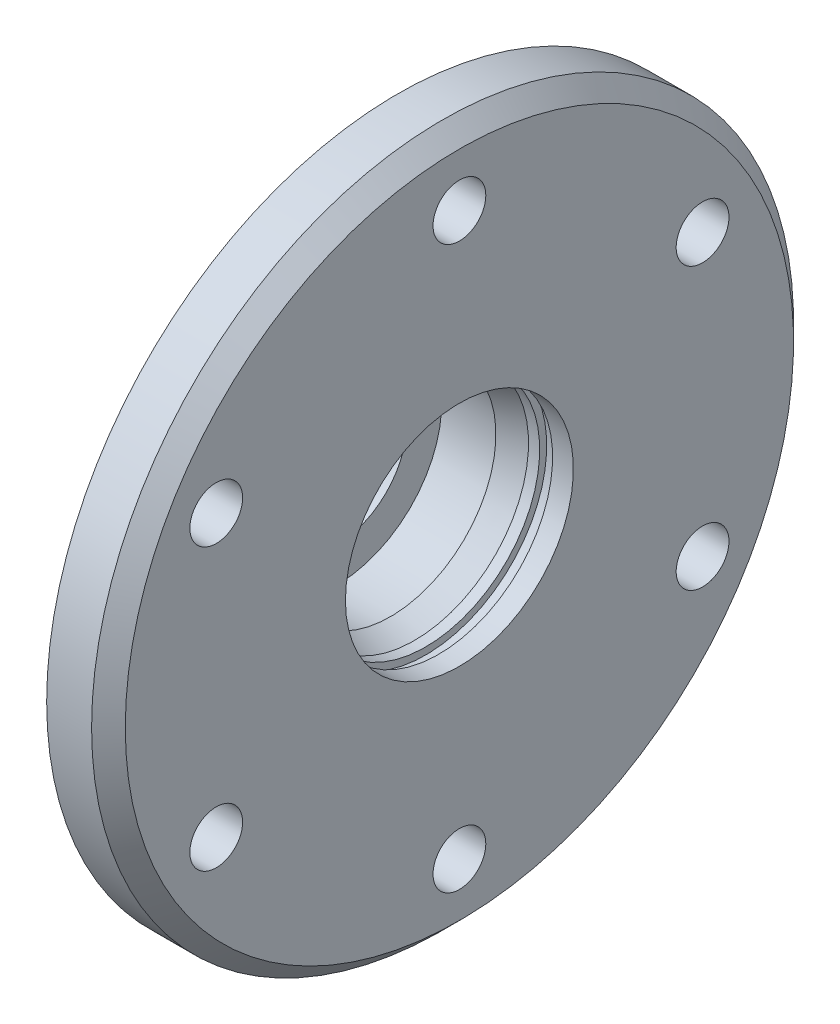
ISO-10303-21;
HEADER;
FILE_DESCRIPTION(('STEP AP214'),'2;1');
FILE_NAME('part.step','',(''),(''),'','','');
FILE_SCHEMA(('AUTOMOTIVE_DESIGN { 1 0 10303 214 1 1 1 1 }'));
ENDSEC;
DATA;
#1=APPLICATION_CONTEXT('core data for automotive mechanical design processes');
#2=APPLICATION_PROTOCOL_DEFINITION('international standard','automotive_design',2000,#1);
#3=PRODUCT_CONTEXT('',#1,'mechanical');
#4=PRODUCT('Part','Part','',(#3));
#5=PRODUCT_RELATED_PRODUCT_CATEGORY('part','',(#4));
#6=PRODUCT_DEFINITION_FORMATION('','',#4);
#7=PRODUCT_DEFINITION_CONTEXT('part definition',#1,'design');
#8=PRODUCT_DEFINITION('design','',#6,#7);
#9=PRODUCT_DEFINITION_SHAPE('','',#8);
#10=(LENGTH_UNIT() NAMED_UNIT(*) SI_UNIT(.MILLI.,.METRE.));
#11=(NAMED_UNIT(*) PLANE_ANGLE_UNIT() SI_UNIT($,.RADIAN.));
#12=(NAMED_UNIT(*) SI_UNIT($,.STERADIAN.) SOLID_ANGLE_UNIT());
#13=UNCERTAINTY_MEASURE_WITH_UNIT(LENGTH_MEASURE(1.E-05),#10,'distance_accuracy_value','');
#14=(GEOMETRIC_REPRESENTATION_CONTEXT(3) GLOBAL_UNCERTAINTY_ASSIGNED_CONTEXT((#13)) GLOBAL_UNIT_ASSIGNED_CONTEXT((#10,
#11,#12)) REPRESENTATION_CONTEXT('',''));
#15=CARTESIAN_POINT('',(0.,0.,0.));
#16=DIRECTION('',(0.,0.,1.));
#17=DIRECTION('',(1.,0.,0.));
#18=AXIS2_PLACEMENT_3D('',#15,#16,#17);
#19=CARTESIAN_POINT('',(-4.88498130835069E-12,10.9982,0.));
#20=DIRECTION('',(1.,0.,0.));
#21=DIRECTION('',(0.,0.,-1.));
#22=AXIS2_PLACEMENT_3D('',#19,#20,#21);
#23=PLANE('',#22);
#24=CARTESIAN_POINT('',(0.,0.,0.));
#25=DIRECTION('',(1.,0.,0.));
#26=DIRECTION('',(0.,0.,-1.));
#27=AXIS2_PLACEMENT_3D('',#24,#25,#26);
#28=CIRCLE('',#27,12.7635);
#29=CARTESIAN_POINT('',(0.,0.,-12.7635));
#30=VERTEX_POINT('',#29);
#31=EDGE_CURVE('E44',#30,#30,#28,.F.);
#32=ORIENTED_EDGE('',*,*,#31,.T.);
#33=EDGE_LOOP('',(#32));
#34=FACE_BOUND('',#33,.T.);
#35=CARTESIAN_POINT('',(0.,0.,0.));
#36=DIRECTION('',(-1.,0.,0.));
#37=DIRECTION('',(0.,0.,1.));
#38=AXIS2_PLACEMENT_3D('',#35,#36,#37);
#39=CIRCLE('',#38,10.9982);
#40=CARTESIAN_POINT('',(0.,0.,10.9982));
#41=VERTEX_POINT('',#40);
#42=EDGE_CURVE('E106',#41,#41,#39,.T.);
#43=ORIENTED_EDGE('',*,*,#42,.F.);
#44=EDGE_LOOP('',(#43));
#45=FACE_BOUND('',#44,.T.);
#46=ADVANCED_FACE('F30',(#34,#45),#23,.F.);
#47=CARTESIAN_POINT('',(0.,0.,0.));
#48=DIRECTION('',(-1.,0.,0.));
#49=DIRECTION('',(0.,0.,1.));
#50=AXIS2_PLACEMENT_3D('',#47,#48,#49);
#51=CYLINDRICAL_SURFACE('',#50,14.2875);
#52=CARTESIAN_POINT('',(1.52399999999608,0.,0.));
#53=DIRECTION('',(1.,0.,0.));
#54=DIRECTION('',(0.,0.,-1.));
#55=AXIS2_PLACEMENT_3D('',#52,#53,#54);
#56=CIRCLE('',#55,14.2875);
#57=CARTESIAN_POINT('',(1.52399999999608,0.,-14.2875));
#58=VERTEX_POINT('',#57);
#59=EDGE_CURVE('E40',#58,#58,#56,.T.);
#60=ORIENTED_EDGE('',*,*,#59,.T.);
#61=EDGE_LOOP('',(#60));
#62=FACE_BOUND('',#61,.T.);
#63=CARTESIAN_POINT('',(12.3952000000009,0.,0.));
#64=DIRECTION('',(-1.,0.,0.));
#65=DIRECTION('',(0.,0.,1.));
#66=AXIS2_PLACEMENT_3D('',#63,#64,#65);
#67=CIRCLE('',#66,14.2875);
#68=CARTESIAN_POINT('',(12.3952000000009,0.,14.2874999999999));
#69=VERTEX_POINT('',#68);
#70=EDGE_CURVE('E61',#69,#69,#67,.T.);
#71=ORIENTED_EDGE('',*,*,#70,.T.);
#72=EDGE_LOOP('',(#71));
#73=FACE_BOUND('',#72,.T.);
#74=ADVANCED_FACE('F234',(#62,#73),#51,.T.);
#75=CARTESIAN_POINT('',(12.3952000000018,14.2875,0.));
#76=DIRECTION('',(1.,0.,0.));
#77=DIRECTION('',(0.,0.,-1.));
#78=AXIS2_PLACEMENT_3D('',#75,#76,#77);
#79=PLANE('',#78);
#80=CARTESIAN_POINT('',(12.3952000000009,0.,0.));
#81=DIRECTION('',(1.,0.,0.));
#82=DIRECTION('',(0.,0.,-1.));
#83=AXIS2_PLACEMENT_3D('',#80,#81,#82);
#84=CIRCLE('',#83,15.748);
#85=CARTESIAN_POINT('',(12.3952000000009,0.,-15.7480000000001));
#86=VERTEX_POINT('',#85);
#87=EDGE_CURVE('E58',#86,#86,#84,.F.);
#88=ORIENTED_EDGE('',*,*,#87,.T.);
#89=EDGE_LOOP('',(#88));
#90=FACE_BOUND('',#89,.T.);
#91=ORIENTED_EDGE('',*,*,#70,.F.);
#92=EDGE_LOOP('',(#91));
#93=FACE_BOUND('',#92,.T.);
#94=ADVANCED_FACE('F239',(#90,#93),#79,.F.);
#95=CARTESIAN_POINT('',(0.,0.,0.));
#96=DIRECTION('',(-1.,0.,0.));
#97=DIRECTION('',(0.,0.,1.));
#98=AXIS2_PLACEMENT_3D('',#95,#96,#97);
#99=CYLINDRICAL_SURFACE('',#98,15.875);
#100=CARTESIAN_POINT('',(12.5222,0.,0.));
#101=DIRECTION('',(1.,0.,0.));
#102=DIRECTION('',(0.,0.,-1.));
#103=AXIS2_PLACEMENT_3D('',#100,#101,#102);
#104=CIRCLE('',#103,15.875);
#105=CARTESIAN_POINT('',(12.5222,0.,-15.8750000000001));
#106=VERTEX_POINT('',#105);
#107=EDGE_CURVE('E55',#106,#106,#104,.T.);
#108=ORIENTED_EDGE('',*,*,#107,.T.);
#109=EDGE_LOOP('',(#108));
#110=FACE_BOUND('',#109,.T.);
#111=CARTESIAN_POINT('',(14.3510000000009,0.,0.));
#112=DIRECTION('',(-1.,0.,0.));
#113=DIRECTION('',(0.,0.,1.));
#114=AXIS2_PLACEMENT_3D('',#111,#112,#113);
#115=CIRCLE('',#114,15.875);
#116=CARTESIAN_POINT('',(14.3510000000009,0.,15.8749999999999));
#117=VERTEX_POINT('',#116);
#118=EDGE_CURVE('E64',#117,#117,#115,.T.);
#119=ORIENTED_EDGE('',*,*,#118,.T.);
#120=EDGE_LOOP('',(#119));
#121=FACE_BOUND('',#120,.T.);
#122=ADVANCED_FACE('F277',(#110,#121),#99,.T.);
#123=CARTESIAN_POINT('',(14.3510000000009,15.8749999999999,0.));
#124=DIRECTION('',(1.,0.,0.));
#125=DIRECTION('',(0.,0.,-1.));
#126=AXIS2_PLACEMENT_3D('',#123,#124,#125);
#127=PLANE('',#126);
#128=ORIENTED_EDGE('',*,*,#118,.F.);
#129=EDGE_LOOP('',(#128));
#130=FACE_BOUND('',#129,.T.);
#131=CARTESIAN_POINT('',(14.3510000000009,0.,0.));
#132=DIRECTION('',(-1.,0.,0.));
#133=DIRECTION('',(0.,0.,1.));
#134=AXIS2_PLACEMENT_3D('',#131,#132,#133);
#135=CIRCLE('',#134,19.4056);
#136=CARTESIAN_POINT('',(14.3510000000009,0.,19.4055999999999));
#137=VERTEX_POINT('',#136);
#138=EDGE_CURVE('E67',#137,#137,#135,.T.);
#139=ORIENTED_EDGE('',*,*,#138,.T.);
#140=EDGE_LOOP('',(#139));
#141=FACE_BOUND('',#140,.T.);
#142=ADVANCED_FACE('F273',(#130,#141),#127,.F.);
#143=CARTESIAN_POINT('',(0.,0.,0.));
#144=DIRECTION('',(-1.,0.,0.));
#145=DIRECTION('',(0.,0.,1.));
#146=AXIS2_PLACEMENT_3D('',#143,#144,#145);
#147=CYLINDRICAL_SURFACE('',#146,19.4056);
#148=CARTESIAN_POINT('',(12.5222,0.,0.));
#149=DIRECTION('',(1.,0.,0.));
#150=DIRECTION('',(0.,0.,-1.));
#151=AXIS2_PLACEMENT_3D('',#148,#149,#150);
#152=CIRCLE('',#151,19.4056);
#153=CARTESIAN_POINT('',(12.5222,0.,-19.4056000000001));
#154=VERTEX_POINT('',#153);
#155=EDGE_CURVE('E52',#154,#154,#152,.F.);
#156=ORIENTED_EDGE('',*,*,#155,.T.);
#157=EDGE_LOOP('',(#156));
#158=FACE_BOUND('',#157,.T.);
#159=ORIENTED_EDGE('',*,*,#138,.F.);
#160=EDGE_LOOP('',(#159));
#161=FACE_BOUND('',#160,.T.);
#162=ADVANCED_FACE('F269',(#158,#161),#147,.F.);
#163=CARTESIAN_POINT('',(12.3952000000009,19.4056,0.));
#164=DIRECTION('',(1.,0.,0.));
#165=DIRECTION('',(0.,0.,-1.));
#166=AXIS2_PLACEMENT_3D('',#163,#164,#165);
#167=PLANE('',#166);
#168=CARTESIAN_POINT('',(12.3951999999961,12.7,21.9970452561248));
#169=DIRECTION('',(1.,0.,0.));
#170=DIRECTION('',(0.,0.,-1.));
#171=AXIS2_PLACEMENT_3D('',#168,#169,#170);
#172=CIRCLE('',#171,2.3876);
#173=CARTESIAN_POINT('',(12.3951999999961,12.7,19.6094452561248));
#174=VERTEX_POINT('',#173);
#175=EDGE_CURVE('E139',#174,#174,#172,.T.);
#176=ORIENTED_EDGE('',*,*,#175,.T.);
#177=EDGE_LOOP('',(#176));
#178=FACE_BOUND('',#177,.T.);
#179=CARTESIAN_POINT('',(12.395200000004,-12.7,21.9970452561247));
#180=DIRECTION('',(1.,0.,0.));
#181=DIRECTION('',(0.,0.,-1.));
#182=AXIS2_PLACEMENT_3D('',#179,#180,#181);
#183=CIRCLE('',#182,2.3876);
#184=CARTESIAN_POINT('',(12.395200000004,-12.7,19.6094452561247));
#185=VERTEX_POINT('',#184);
#186=EDGE_CURVE('E133',#185,#185,#183,.T.);
#187=ORIENTED_EDGE('',*,*,#186,.T.);
#188=EDGE_LOOP('',(#187));
#189=FACE_BOUND('',#188,.T.);
#190=CARTESIAN_POINT('',(12.3951999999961,-25.3999999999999,0.));
#191=DIRECTION('',(1.,0.,0.));
#192=DIRECTION('',(0.,0.,-1.));
#193=AXIS2_PLACEMENT_3D('',#190,#191,#192);
#194=CIRCLE('',#193,2.3876);
#195=CARTESIAN_POINT('',(12.3951999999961,-25.3999999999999,-2.38759999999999));
#196=VERTEX_POINT('',#195);
#197=EDGE_CURVE('E127',#196,#196,#194,.T.);
#198=ORIENTED_EDGE('',*,*,#197,.T.);
#199=EDGE_LOOP('',(#198));
#200=FACE_BOUND('',#199,.T.);
#201=CARTESIAN_POINT('',(12.3952000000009,-12.7,-21.9970452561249));
#202=DIRECTION('',(1.,0.,0.));
#203=DIRECTION('',(0.,0.,-1.));
#204=AXIS2_PLACEMENT_3D('',#201,#202,#203);
#205=CIRCLE('',#204,2.3876);
#206=CARTESIAN_POINT('',(12.3952000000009,-12.7,-24.3846452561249));
#207=VERTEX_POINT('',#206);
#208=EDGE_CURVE('E121',#207,#207,#205,.T.);
#209=ORIENTED_EDGE('',*,*,#208,.T.);
#210=EDGE_LOOP('',(#209));
#211=FACE_BOUND('',#210,.T.);
#212=CARTESIAN_POINT('',(12.3952000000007,12.6999999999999,-21.997045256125));
#213=DIRECTION('',(1.,0.,0.));
#214=DIRECTION('',(0.,0.,-1.));
#215=AXIS2_PLACEMENT_3D('',#212,#213,#214);
#216=CIRCLE('',#215,2.3876);
#217=CARTESIAN_POINT('',(12.3952000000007,12.6999999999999,-24.384645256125));
#218=VERTEX_POINT('',#217);
#219=EDGE_CURVE('E115',#218,#218,#216,.T.);
#220=ORIENTED_EDGE('',*,*,#219,.T.);
#221=EDGE_LOOP('',(#220));
#222=FACE_BOUND('',#221,.T.);
#223=CARTESIAN_POINT('',(12.3951999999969,25.4,0.));
#224=DIRECTION('',(1.,0.,0.));
#225=DIRECTION('',(0.,0.,-1.));
#226=AXIS2_PLACEMENT_3D('',#223,#224,#225);
#227=CIRCLE('',#226,2.3876);
#228=CARTESIAN_POINT('',(12.3951999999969,25.4,-2.38760000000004));
#229=VERTEX_POINT('',#228);
#230=EDGE_CURVE('E109',#229,#229,#227,.T.);
#231=ORIENTED_EDGE('',*,*,#230,.T.);
#232=EDGE_LOOP('',(#231));
#233=FACE_BOUND('',#232,.T.);
#234=CARTESIAN_POINT('',(12.3952000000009,0.,0.));
#235=DIRECTION('',(1.,0.,0.));
#236=DIRECTION('',(0.,0.,-1.));
#237=AXIS2_PLACEMENT_3D('',#234,#235,#236);
#238=CIRCLE('',#237,19.5326);
#239=CARTESIAN_POINT('',(12.3952000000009,0.,-19.5326));
#240=VERTEX_POINT('',#239);
#241=EDGE_CURVE('E49',#240,#240,#238,.T.);
#242=ORIENTED_EDGE('',*,*,#241,.T.);
#243=EDGE_LOOP('',(#242));
#244=FACE_BOUND('',#243,.T.);
#245=CARTESIAN_POINT('',(12.3952000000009,0.,0.));
#246=DIRECTION('',(-1.,0.,0.));
#247=DIRECTION('',(0.,0.,1.));
#248=AXIS2_PLACEMENT_3D('',#245,#246,#247);
#249=CIRCLE('',#248,31.75);
#250=CARTESIAN_POINT('',(12.3952000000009,0.,31.7499999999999));
#251=VERTEX_POINT('',#250);
#252=EDGE_CURVE('E70',#251,#251,#249,.T.);
#253=ORIENTED_EDGE('',*,*,#252,.T.);
#254=EDGE_LOOP('',(#253));
#255=FACE_BOUND('',#254,.T.);
#256=ADVANCED_FACE('F266',(#178,#189,#200,#211,#222,#233,#244,#255),#167,.F.);
#257=CARTESIAN_POINT('',(0.,0.,0.));
#258=DIRECTION('',(-1.,0.,0.));
#259=DIRECTION('',(0.,0.,1.));
#260=AXIS2_PLACEMENT_3D('',#257,#258,#259);
#261=CYLINDRICAL_SURFACE('',#260,31.75);
#262=CARTESIAN_POINT('',(16.4591999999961,0.,0.));
#263=DIRECTION('',(-1.,0.,0.));
#264=DIRECTION('',(0.,0.,1.));
#265=AXIS2_PLACEMENT_3D('',#262,#263,#264);
#266=CIRCLE('',#265,31.75);
#267=CARTESIAN_POINT('',(16.4591999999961,0.,31.75));
#268=VERTEX_POINT('',#267);
#269=EDGE_CURVE('E36',#268,#268,#266,.T.);
#270=ORIENTED_EDGE('',*,*,#269,.T.);
#271=EDGE_LOOP('',(#270));
#272=FACE_BOUND('',#271,.T.);
#273=ORIENTED_EDGE('',*,*,#252,.F.);
#274=EDGE_LOOP('',(#273));
#275=FACE_BOUND('',#274,.T.);
#276=ADVANCED_FACE('F153',(#272,#275),#261,.T.);
#277=CARTESIAN_POINT('',(17.9831999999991,10.3123999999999,0.));
#278=DIRECTION('',(-1.,0.,0.));
#279=DIRECTION('',(0.,0.,1.));
#280=AXIS2_PLACEMENT_3D('',#277,#278,#279);
#281=PLANE('',#280);
#282=CARTESIAN_POINT('',(17.9832,12.7,21.9970452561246));
#283=DIRECTION('',(1.,0.,0.));
#284=DIRECTION('',(0.,0.,-1.));
#285=AXIS2_PLACEMENT_3D('',#282,#283,#284);
#286=CIRCLE('',#285,2.3876);
#287=CARTESIAN_POINT('',(17.9832,12.7,19.6094452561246));
#288=VERTEX_POINT('',#287);
#289=EDGE_CURVE('E142',#288,#288,#286,.T.);
#290=ORIENTED_EDGE('',*,*,#289,.F.);
#291=EDGE_LOOP('',(#290));
#292=FACE_BOUND('',#291,.T.);
#293=CARTESIAN_POINT('',(17.9831999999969,-12.7,21.9970452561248));
#294=DIRECTION('',(1.,0.,0.));
#295=DIRECTION('',(0.,0.,-1.));
#296=AXIS2_PLACEMENT_3D('',#293,#294,#295);
#297=CIRCLE('',#296,2.3876);
#298=CARTESIAN_POINT('',(17.9831999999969,-12.7,19.6094452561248));
#299=VERTEX_POINT('',#298);
#300=EDGE_CURVE('E136',#299,#299,#297,.T.);
#301=ORIENTED_EDGE('',*,*,#300,.F.);
#302=EDGE_LOOP('',(#301));
#303=FACE_BOUND('',#302,.T.);
#304=CARTESIAN_POINT('',(17.9831999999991,-25.4,0.));
#305=DIRECTION('',(1.,0.,0.));
#306=DIRECTION('',(0.,0.,-1.));
#307=AXIS2_PLACEMENT_3D('',#304,#305,#306);
#308=CIRCLE('',#307,2.3876);
#309=CARTESIAN_POINT('',(17.9831999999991,-25.4,-2.3876));
#310=VERTEX_POINT('',#309);
#311=EDGE_CURVE('E130',#310,#310,#308,.T.);
#312=ORIENTED_EDGE('',*,*,#311,.F.);
#313=EDGE_LOOP('',(#312));
#314=FACE_BOUND('',#313,.T.);
#315=CARTESIAN_POINT('',(17.9832,-12.7,-21.997045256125));
#316=DIRECTION('',(1.,0.,0.));
#317=DIRECTION('',(0.,0.,-1.));
#318=AXIS2_PLACEMENT_3D('',#315,#316,#317);
#319=CIRCLE('',#318,2.3876);
#320=CARTESIAN_POINT('',(17.9832,-12.7,-24.384645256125));
#321=VERTEX_POINT('',#320);
#322=EDGE_CURVE('E124',#321,#321,#319,.T.);
#323=ORIENTED_EDGE('',*,*,#322,.F.);
#324=EDGE_LOOP('',(#323));
#325=FACE_BOUND('',#324,.T.);
#326=CARTESIAN_POINT('',(17.9832,12.6999999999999,-21.9970452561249));
#327=DIRECTION('',(1.,0.,0.));
#328=DIRECTION('',(0.,0.,-1.));
#329=AXIS2_PLACEMENT_3D('',#326,#327,#328);
#330=CIRCLE('',#329,2.3876);
#331=CARTESIAN_POINT('',(17.9832,12.6999999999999,-24.3846452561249));
#332=VERTEX_POINT('',#331);
#333=EDGE_CURVE('E118',#332,#332,#330,.T.);
#334=ORIENTED_EDGE('',*,*,#333,.F.);
#335=EDGE_LOOP('',(#334));
#336=FACE_BOUND('',#335,.T.);
#337=CARTESIAN_POINT('',(17.9831999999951,25.4,0.));
#338=DIRECTION('',(1.,0.,0.));
#339=DIRECTION('',(0.,0.,-1.));
#340=AXIS2_PLACEMENT_3D('',#337,#338,#339);
#341=CIRCLE('',#340,2.3876);
#342=CARTESIAN_POINT('',(17.9831999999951,25.4,-2.3876));
#343=VERTEX_POINT('',#342);
#344=EDGE_CURVE('E112',#343,#343,#341,.T.);
#345=ORIENTED_EDGE('',*,*,#344,.F.);
#346=EDGE_LOOP('',(#345));
#347=FACE_BOUND('',#346,.T.);
#348=CARTESIAN_POINT('',(17.9832,0.,0.));
#349=DIRECTION('',(-1.,0.,0.));
#350=DIRECTION('',(0.,0.,1.));
#351=AXIS2_PLACEMENT_3D('',#348,#349,#350);
#352=CIRCLE('',#351,30.226);
#353=CARTESIAN_POINT('',(17.9832,0.,30.226));
#354=VERTEX_POINT('',#353);
#355=EDGE_CURVE('E10',#354,#354,#352,.F.);
#356=ORIENTED_EDGE('',*,*,#355,.T.);
#357=EDGE_LOOP('',(#356));
#358=FACE_BOUND('',#357,.T.);
#359=CARTESIAN_POINT('',(17.9832,0.,0.));
#360=DIRECTION('',(-1.,0.,0.));
#361=DIRECTION('',(0.,0.,1.));
#362=AXIS2_PLACEMENT_3D('',#359,#360,#361);
#363=CIRCLE('',#362,10.3124);
#364=CARTESIAN_POINT('',(17.9832,0.,10.3124));
#365=VERTEX_POINT('',#364);
#366=EDGE_CURVE('E73',#365,#365,#363,.T.);
#367=ORIENTED_EDGE('',*,*,#366,.T.);
#368=EDGE_LOOP('',(#367));
#369=FACE_BOUND('',#368,.T.);
#370=ADVANCED_FACE('F149',(#292,#303,#314,#325,#336,#347,#358,#369),#281,.F.);
#371=CARTESIAN_POINT('',(0.,0.,0.));
#372=DIRECTION('',(-1.,0.,0.));
#373=DIRECTION('',(0.,0.,1.));
#374=AXIS2_PLACEMENT_3D('',#371,#372,#373);
#375=CYLINDRICAL_SURFACE('',#374,10.3124);
#376=ORIENTED_EDGE('',*,*,#366,.F.);
#377=EDGE_LOOP('',(#376));
#378=FACE_BOUND('',#377,.T.);
#379=CARTESIAN_POINT('',(16.1035999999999,0.,0.));
#380=DIRECTION('',(-1.,0.,0.));
#381=DIRECTION('',(0.,0.,1.));
#382=AXIS2_PLACEMENT_3D('',#379,#380,#381);
#383=CIRCLE('',#382,10.3124);
#384=CARTESIAN_POINT('',(16.1035999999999,0.,10.3123999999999));
#385=VERTEX_POINT('',#384);
#386=EDGE_CURVE('E76',#385,#385,#383,.T.);
#387=ORIENTED_EDGE('',*,*,#386,.T.);
#388=EDGE_LOOP('',(#387));
#389=FACE_BOUND('',#388,.T.);
#390=ADVANCED_FACE('F152',(#378,#389),#375,.F.);
#391=CARTESIAN_POINT('',(16.103599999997,10.3124,0.));
#392=DIRECTION('',(1.,0.,0.));
#393=DIRECTION('',(0.,0.,-1.));
#394=AXIS2_PLACEMENT_3D('',#391,#392,#393);
#395=PLANE('',#394);
#396=ORIENTED_EDGE('',*,*,#386,.F.);
#397=EDGE_LOOP('',(#396));
#398=FACE_BOUND('',#397,.T.);
#399=CARTESIAN_POINT('',(16.1035999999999,0.,0.));
#400=DIRECTION('',(-1.,0.,0.));
#401=DIRECTION('',(0.,0.,1.));
#402=AXIS2_PLACEMENT_3D('',#399,#400,#401);
#403=CIRCLE('',#402,10.9474);
#404=CARTESIAN_POINT('',(16.1035999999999,0.,10.9473999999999));
#405=VERTEX_POINT('',#404);
#406=EDGE_CURVE('E79',#405,#405,#403,.T.);
#407=ORIENTED_EDGE('',*,*,#406,.T.);
#408=EDGE_LOOP('',(#407));
#409=FACE_BOUND('',#408,.T.);
#410=ADVANCED_FACE('F169',(#398,#409),#395,.F.);
#411=CARTESIAN_POINT('',(0.,0.,0.));
#412=DIRECTION('',(-1.,0.,0.));
#413=DIRECTION('',(0.,0.,1.));
#414=AXIS2_PLACEMENT_3D('',#411,#412,#413);
#415=CYLINDRICAL_SURFACE('',#414,10.9474);
#416=ORIENTED_EDGE('',*,*,#406,.F.);
#417=EDGE_LOOP('',(#416));
#418=FACE_BOUND('',#417,.T.);
#419=CARTESIAN_POINT('',(14.9352,0.,0.));
#420=DIRECTION('',(-1.,0.,0.));
#421=DIRECTION('',(0.,0.,1.));
#422=AXIS2_PLACEMENT_3D('',#419,#420,#421);
#423=CIRCLE('',#422,10.9474);
#424=CARTESIAN_POINT('',(14.9352,0.,10.9473999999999));
#425=VERTEX_POINT('',#424);
#426=EDGE_CURVE('E82',#425,#425,#423,.T.);
#427=ORIENTED_EDGE('',*,*,#426,.T.);
#428=EDGE_LOOP('',(#427));
#429=FACE_BOUND('',#428,.T.);
#430=ADVANCED_FACE('F175',(#418,#429),#415,.F.);
#431=CARTESIAN_POINT('',(14.9352,10.9473999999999,0.));
#432=DIRECTION('',(-1.,0.,0.));
#433=DIRECTION('',(0.,0.,1.));
#434=AXIS2_PLACEMENT_3D('',#431,#432,#433);
#435=PLANE('',#434);
#436=ORIENTED_EDGE('',*,*,#426,.F.);
#437=EDGE_LOOP('',(#436));
#438=FACE_BOUND('',#437,.T.);
#439=CARTESIAN_POINT('',(14.9352,0.,0.));
#440=DIRECTION('',(-1.,0.,0.));
#441=DIRECTION('',(0.,0.,1.));
#442=AXIS2_PLACEMENT_3D('',#439,#440,#441);
#443=CIRCLE('',#442,10.3124);
#444=CARTESIAN_POINT('',(14.9352,0.,10.3123999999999));
#445=VERTEX_POINT('',#444);
#446=EDGE_CURVE('E85',#445,#445,#443,.T.);
#447=ORIENTED_EDGE('',*,*,#446,.T.);
#448=EDGE_LOOP('',(#447));
#449=FACE_BOUND('',#448,.T.);
#450=ADVANCED_FACE('F181',(#438,#449),#435,.F.);
#451=CARTESIAN_POINT('',(0.,0.,0.));
#452=DIRECTION('',(-1.,0.,0.));
#453=DIRECTION('',(0.,0.,1.));
#454=AXIS2_PLACEMENT_3D('',#451,#452,#453);
#455=CYLINDRICAL_SURFACE('',#454,10.3124);
#456=ORIENTED_EDGE('',*,*,#446,.F.);
#457=EDGE_LOOP('',(#456));
#458=FACE_BOUND('',#457,.T.);
#459=CARTESIAN_POINT('',(13.9235637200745,0.,0.));
#460=DIRECTION('',(-1.,0.,0.));
#461=DIRECTION('',(0.,0.,1.));
#462=AXIS2_PLACEMENT_3D('',#459,#460,#461);
#463=CIRCLE('',#462,10.3124);
#464=CARTESIAN_POINT('',(13.9235637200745,0.,10.3124));
#465=VERTEX_POINT('',#464);
#466=EDGE_CURVE('E88',#465,#465,#463,.T.);
#467=ORIENTED_EDGE('',*,*,#466,.T.);
#468=EDGE_LOOP('',(#467));
#469=FACE_BOUND('',#468,.T.);
#470=ADVANCED_FACE('F187',(#458,#469),#455,.F.);
#471=CARTESIAN_POINT('',(11.7602000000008,0.,0.));
#472=DIRECTION('',(1.,0.,0.));
#473=DIRECTION('',(0.,0.,-1.));
#474=AXIS2_PLACEMENT_3D('',#471,#472,#473);
#475=CONICAL_SURFACE('',#474,9.525,0.349065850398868);
#476=ORIENTED_EDGE('',*,*,#466,.F.);
#477=EDGE_LOOP('',(#476));
#478=FACE_BOUND('',#477,.T.);
#479=CARTESIAN_POINT('',(11.7602000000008,0.,0.));
#480=DIRECTION('',(-1.,0.,0.));
#481=DIRECTION('',(0.,0.,1.));
#482=AXIS2_PLACEMENT_3D('',#479,#480,#481);
#483=CIRCLE('',#482,9.525);
#484=CARTESIAN_POINT('',(11.7602000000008,0.,9.52499999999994));
#485=VERTEX_POINT('',#484);
#486=EDGE_CURVE('E91',#485,#485,#483,.T.);
#487=ORIENTED_EDGE('',*,*,#486,.T.);
#488=EDGE_LOOP('',(#487));
#489=FACE_BOUND('',#488,.T.);
#490=ADVANCED_FACE('F193',(#478,#489),#475,.F.);
#491=CARTESIAN_POINT('',(0.,0.,0.));
#492=DIRECTION('',(-1.,0.,0.));
#493=DIRECTION('',(0.,0.,1.));
#494=AXIS2_PLACEMENT_3D('',#491,#492,#493);
#495=CYLINDRICAL_SURFACE('',#494,9.525);
#496=ORIENTED_EDGE('',*,*,#486,.F.);
#497=EDGE_LOOP('',(#496));
#498=FACE_BOUND('',#497,.T.);
#499=CARTESIAN_POINT('',(6.85800000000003,0.,0.));
#500=DIRECTION('',(-1.,0.,0.));
#501=DIRECTION('',(0.,0.,1.));
#502=AXIS2_PLACEMENT_3D('',#499,#500,#501);
#503=CIRCLE('',#502,9.525);
#504=CARTESIAN_POINT('',(6.85800000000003,0.,9.525));
#505=VERTEX_POINT('',#504);
#506=EDGE_CURVE('E94',#505,#505,#503,.T.);
#507=ORIENTED_EDGE('',*,*,#506,.T.);
#508=EDGE_LOOP('',(#507));
#509=FACE_BOUND('',#508,.T.);
#510=ADVANCED_FACE('F199',(#498,#509),#495,.F.);
#511=CARTESIAN_POINT('',(6.85800000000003,6.37539999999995,0.));
#512=DIRECTION('',(-1.,0.,0.));
#513=DIRECTION('',(0.,0.,1.));
#514=AXIS2_PLACEMENT_3D('',#511,#512,#513);
#515=PLANE('',#514);
#516=ORIENTED_EDGE('',*,*,#506,.F.);
#517=EDGE_LOOP('',(#516));
#518=FACE_BOUND('',#517,.T.);
#519=CARTESIAN_POINT('',(6.85800000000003,0.,0.));
#520=DIRECTION('',(-1.,0.,0.));
#521=DIRECTION('',(0.,0.,1.));
#522=AXIS2_PLACEMENT_3D('',#519,#520,#521);
#523=CIRCLE('',#522,6.37539999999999);
#524=CARTESIAN_POINT('',(6.85800000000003,0.,6.37539999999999));
#525=VERTEX_POINT('',#524);
#526=EDGE_CURVE('E97',#525,#525,#523,.T.);
#527=ORIENTED_EDGE('',*,*,#526,.T.);
#528=EDGE_LOOP('',(#527));
#529=FACE_BOUND('',#528,.T.);
#530=ADVANCED_FACE('F205',(#518,#529),#515,.F.);
#531=CARTESIAN_POINT('',(0.,0.,0.));
#532=DIRECTION('',(-1.,0.,0.));
#533=DIRECTION('',(0.,0.,1.));
#534=AXIS2_PLACEMENT_3D('',#531,#532,#533);
#535=CYLINDRICAL_SURFACE('',#534,6.37539999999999);
#536=ORIENTED_EDGE('',*,*,#526,.F.);
#537=EDGE_LOOP('',(#536));
#538=FACE_BOUND('',#537,.T.);
#539=CARTESIAN_POINT('',(3.04800000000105,0.,0.));
#540=DIRECTION('',(-1.,0.,0.));
#541=DIRECTION('',(0.,0.,1.));
#542=AXIS2_PLACEMENT_3D('',#539,#540,#541);
#543=CIRCLE('',#542,6.37539999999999);
#544=CARTESIAN_POINT('',(3.04800000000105,0.,6.37539999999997));
#545=VERTEX_POINT('',#544);
#546=EDGE_CURVE('E100',#545,#545,#543,.T.);
#547=ORIENTED_EDGE('',*,*,#546,.T.);
#548=EDGE_LOOP('',(#547));
#549=FACE_BOUND('',#548,.T.);
#550=ADVANCED_FACE('F211',(#538,#549),#535,.F.);
#551=CARTESIAN_POINT('',(3.04799999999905,10.9982,0.));
#552=DIRECTION('',(1.,0.,0.));
#553=DIRECTION('',(0.,0.,-1.));
#554=AXIS2_PLACEMENT_3D('',#551,#552,#553);
#555=PLANE('',#554);
#556=ORIENTED_EDGE('',*,*,#546,.F.);
#557=EDGE_LOOP('',(#556));
#558=FACE_BOUND('',#557,.T.);
#559=CARTESIAN_POINT('',(3.04800000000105,0.,0.));
#560=DIRECTION('',(-1.,0.,0.));
#561=DIRECTION('',(0.,0.,1.));
#562=AXIS2_PLACEMENT_3D('',#559,#560,#561);
#563=CIRCLE('',#562,10.9982);
#564=CARTESIAN_POINT('',(3.04800000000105,0.,10.9982));
#565=VERTEX_POINT('',#564);
#566=EDGE_CURVE('E103',#565,#565,#563,.T.);
#567=ORIENTED_EDGE('',*,*,#566,.T.);
#568=EDGE_LOOP('',(#567));
#569=FACE_BOUND('',#568,.T.);
#570=ADVANCED_FACE('F217',(#558,#569),#555,.F.);
#571=CARTESIAN_POINT('',(0.,0.,0.));
#572=DIRECTION('',(-1.,0.,0.));
#573=DIRECTION('',(0.,0.,1.));
#574=AXIS2_PLACEMENT_3D('',#571,#572,#573);
#575=CYLINDRICAL_SURFACE('',#574,10.9982);
#576=ORIENTED_EDGE('',*,*,#566,.F.);
#577=EDGE_LOOP('',(#576));
#578=FACE_BOUND('',#577,.T.);
#579=ORIENTED_EDGE('',*,*,#42,.T.);
#580=EDGE_LOOP('',(#579));
#581=FACE_BOUND('',#580,.T.);
#582=ADVANCED_FACE('F223',(#578,#581),#575,.F.);
#583=CARTESIAN_POINT('',(12.5222,0.,0.));
#584=DIRECTION('',(1.,0.,0.));
#585=DIRECTION('',(0.,0.,-1.));
#586=AXIS2_PLACEMENT_3D('',#583,#584,#585);
#587=TOROIDAL_SURFACE('',#586,15.748,0.127);
#588=ORIENTED_EDGE('',*,*,#107,.F.);
#589=EDGE_LOOP('',(#588));
#590=FACE_BOUND('',#589,.T.);
#591=ORIENTED_EDGE('',*,*,#87,.F.);
#592=EDGE_LOOP('',(#591));
#593=FACE_BOUND('',#592,.T.);
#594=ADVANCED_FACE('F229',(#590,#593),#587,.T.);
#595=CARTESIAN_POINT('',(12.5222,0.,0.));
#596=DIRECTION('',(1.,0.,0.));
#597=DIRECTION('',(0.,0.,-1.));
#598=AXIS2_PLACEMENT_3D('',#595,#596,#597);
#599=TOROIDAL_SURFACE('',#598,19.5326,0.127);
#600=ORIENTED_EDGE('',*,*,#241,.F.);
#601=EDGE_LOOP('',(#600));
#602=FACE_BOUND('',#601,.T.);
#603=ORIENTED_EDGE('',*,*,#155,.F.);
#604=EDGE_LOOP('',(#603));
#605=FACE_BOUND('',#604,.T.);
#606=ADVANCED_FACE('F246',(#602,#605),#599,.T.);
#607=CARTESIAN_POINT('',(0.,0.,0.));
#608=DIRECTION('',(1.,0.,0.));
#609=DIRECTION('',(0.,0.,-1.));
#610=AXIS2_PLACEMENT_3D('',#607,#608,#609);
#611=CONICAL_SURFACE('',#610,12.7635,0.785398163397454);
#612=ORIENTED_EDGE('',*,*,#59,.F.);
#613=EDGE_LOOP('',(#612));
#614=FACE_BOUND('',#613,.T.);
#615=ORIENTED_EDGE('',*,*,#31,.F.);
#616=EDGE_LOOP('',(#615));
#617=FACE_BOUND('',#616,.T.);
#618=ADVANCED_FACE('F243',(#614,#617),#611,.T.);
#619=CARTESIAN_POINT('',(16.4591999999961,0.,0.));
#620=DIRECTION('',(-1.,0.,0.));
#621=DIRECTION('',(0.,0.,1.));
#622=AXIS2_PLACEMENT_3D('',#619,#620,#621);
#623=CONICAL_SURFACE('',#622,31.75,0.785398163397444);
#624=ORIENTED_EDGE('',*,*,#355,.F.);
#625=EDGE_LOOP('',(#624));
#626=FACE_BOUND('',#625,.T.);
#627=ORIENTED_EDGE('',*,*,#269,.F.);
#628=EDGE_LOOP('',(#627));
#629=FACE_BOUND('',#628,.T.);
#630=ADVANCED_FACE('F245',(#626,#629),#623,.T.);
#631=CARTESIAN_POINT('',(8.88178419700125E-13,25.4,0.));
#632=DIRECTION('',(1.,0.,0.));
#633=DIRECTION('',(0.,0.,-1.));
#634=AXIS2_PLACEMENT_3D('',#631,#632,#633);
#635=CYLINDRICAL_SURFACE('',#634,2.3876);
#636=ORIENTED_EDGE('',*,*,#344,.T.);
#637=EDGE_LOOP('',(#636));
#638=FACE_BOUND('',#637,.T.);
#639=ORIENTED_EDGE('',*,*,#230,.F.);
#640=EDGE_LOOP('',(#639));
#641=FACE_BOUND('',#640,.T.);
#642=ADVANCED_FACE('F253',(#638,#641),#635,.F.);
#643=CARTESIAN_POINT('',(-3.99680288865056E-12,12.6999999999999,-21.9970452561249));
#644=DIRECTION('',(1.,0.,0.));
#645=DIRECTION('',(0.,0.,-1.));
#646=AXIS2_PLACEMENT_3D('',#643,#644,#645);
#647=CYLINDRICAL_SURFACE('',#646,2.3876);
#648=ORIENTED_EDGE('',*,*,#333,.T.);
#649=EDGE_LOOP('',(#648));
#650=FACE_BOUND('',#649,.T.);
#651=ORIENTED_EDGE('',*,*,#219,.F.);
#652=EDGE_LOOP('',(#651));
#653=FACE_BOUND('',#652,.T.);
#654=ADVANCED_FACE('F388',(#650,#653),#647,.F.);
#655=CARTESIAN_POINT('',(8.88178419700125E-13,-12.7,-21.9970452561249));
#656=DIRECTION('',(1.,0.,0.));
#657=DIRECTION('',(0.,0.,-1.));
#658=AXIS2_PLACEMENT_3D('',#655,#656,#657);
#659=CYLINDRICAL_SURFACE('',#658,2.3876);
#660=ORIENTED_EDGE('',*,*,#322,.T.);
#661=EDGE_LOOP('',(#660));
#662=FACE_BOUND('',#661,.T.);
#663=ORIENTED_EDGE('',*,*,#208,.F.);
#664=EDGE_LOOP('',(#663));
#665=FACE_BOUND('',#664,.T.);
#666=ADVANCED_FACE('F397',(#662,#665),#659,.F.);
#667=CARTESIAN_POINT('',(-3.99680288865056E-12,-25.3999999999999,0.));
#668=DIRECTION('',(1.,0.,0.));
#669=DIRECTION('',(0.,0.,-1.));
#670=AXIS2_PLACEMENT_3D('',#667,#668,#669);
#671=CYLINDRICAL_SURFACE('',#670,2.3876);
#672=ORIENTED_EDGE('',*,*,#311,.T.);
#673=EDGE_LOOP('',(#672));
#674=FACE_BOUND('',#673,.T.);
#675=ORIENTED_EDGE('',*,*,#197,.F.);
#676=EDGE_LOOP('',(#675));
#677=FACE_BOUND('',#676,.T.);
#678=ADVANCED_FACE('F407',(#674,#677),#671,.F.);
#679=CARTESIAN_POINT('',(0.,-12.7,21.9970452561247));
#680=DIRECTION('',(1.,0.,0.));
#681=DIRECTION('',(0.,0.,-1.));
#682=AXIS2_PLACEMENT_3D('',#679,#680,#681);
#683=CYLINDRICAL_SURFACE('',#682,2.3876);
#684=ORIENTED_EDGE('',*,*,#300,.T.);
#685=EDGE_LOOP('',(#684));
#686=FACE_BOUND('',#685,.T.);
#687=ORIENTED_EDGE('',*,*,#186,.F.);
#688=EDGE_LOOP('',(#687));
#689=FACE_BOUND('',#688,.T.);
#690=ADVANCED_FACE('F417',(#686,#689),#683,.F.);
#691=CARTESIAN_POINT('',(-8.88178419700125E-13,12.7,21.9970452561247));
#692=DIRECTION('',(1.,0.,0.));
#693=DIRECTION('',(0.,0.,-1.));
#694=AXIS2_PLACEMENT_3D('',#691,#692,#693);
#695=CYLINDRICAL_SURFACE('',#694,2.3876);
#696=ORIENTED_EDGE('',*,*,#289,.T.);
#697=EDGE_LOOP('',(#696));
#698=FACE_BOUND('',#697,.T.);
#699=ORIENTED_EDGE('',*,*,#175,.F.);
#700=EDGE_LOOP('',(#699));
#701=FACE_BOUND('',#700,.T.);
#702=ADVANCED_FACE('F146',(#698,#701),#695,.F.);
#703=CLOSED_SHELL('',(#46,#74,#94,#122,#142,#162,#256,#276,#370,#390,#410,#430,#450,#470,#490,
#510,#530,#550,#570,#582,#594,#606,#618,#630,#642,#654,#666,#678,#690,#702));
#704=MANIFOLD_SOLID_BREP('B2',#703);
#705=ADVANCED_BREP_SHAPE_REPRESENTATION('',(#18,#704),#14);
#706=SHAPE_DEFINITION_REPRESENTATION(#9,#705);
ENDSEC;
END-ISO-10303-21;
